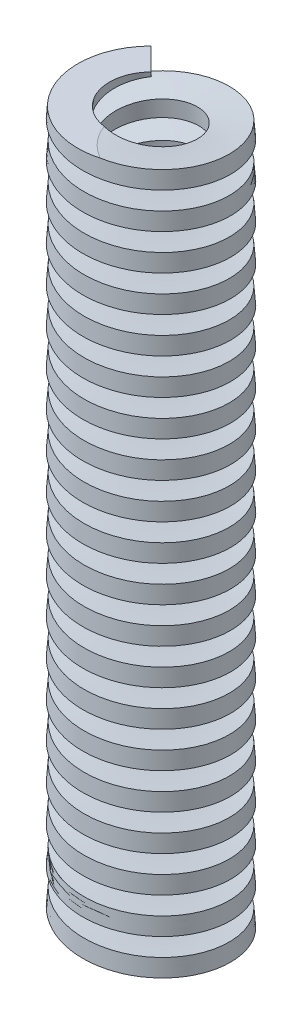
from build123d import *

# Parameters (mm, degrees)
BALAYAGE1_PITCH              = 1.87
BALAYAGE1_HEIGHT             = 37.4
BALAYAGE1_RADIUS             = 3.85
BALAYAGE1_START_ANGLE        = -135
ESQUISSE3_W                  = 1.65
ESQUISSE3_H                  = 0.88
ENL_V_MAT_EXTRU_1_DEPTH      = 39.661998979
ENL_V_MAT_EXTRU_1_DEPTH_BACK = 39.661998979
ESQUISSE4_W                  = 10
ESQUISSE4_H                  = 1.5
ESQUISSE4_H_2                = 5


with BuildPart() as part:
    # Balayage1: sweep along a helix
    with BuildLine() as balayage1_path:
        add(Helix(BALAYAGE1_PITCH, BALAYAGE1_HEIGHT, BALAYAGE1_RADIUS, center=(0, 0, 0), direction=(0, 1, 0), lefthand=True, mode=Mode.PRIVATE).rotate(Axis((0, 0, 0), (0, 1, 0)), BALAYAGE1_START_ANGLE))
    # Esquisse3 → Balayage1 (sweep)
    with BuildSketch(Plane(origin=(-2.722361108, 0, -2.722361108), x_dir=(-0.7092036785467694, 0.07580747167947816, -0.7009160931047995), z_dir=(0.7050034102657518, 0.07707388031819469, -0.7050034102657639))):
        with Locations((-0.817705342, 0.439826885)):
            Rectangle(ESQUISSE3_W, ESQUISSE3_H)
    sweep(path=balayage1_path.line, is_frenet=True)

    # Esquisse4 → Enl_v. mat.-Extru.1 (cut, two sides: drawn at the far end of the back side and taken through both)
    with BuildSketch(Plane.XY.offset(-ENL_V_MAT_EXTRU_1_DEPTH_BACK)):
        with Locations((0, -0.25)):
            Rectangle(ESQUISSE4_W, ESQUISSE4_H)
        with Locations((0, 40)):
            Rectangle(ESQUISSE4_W, ESQUISSE4_H_2)
    extrude(amount=ENL_V_MAT_EXTRU_1_DEPTH + ENL_V_MAT_EXTRU_1_DEPTH_BACK, mode=Mode.SUBTRACT)


solid = part.part
